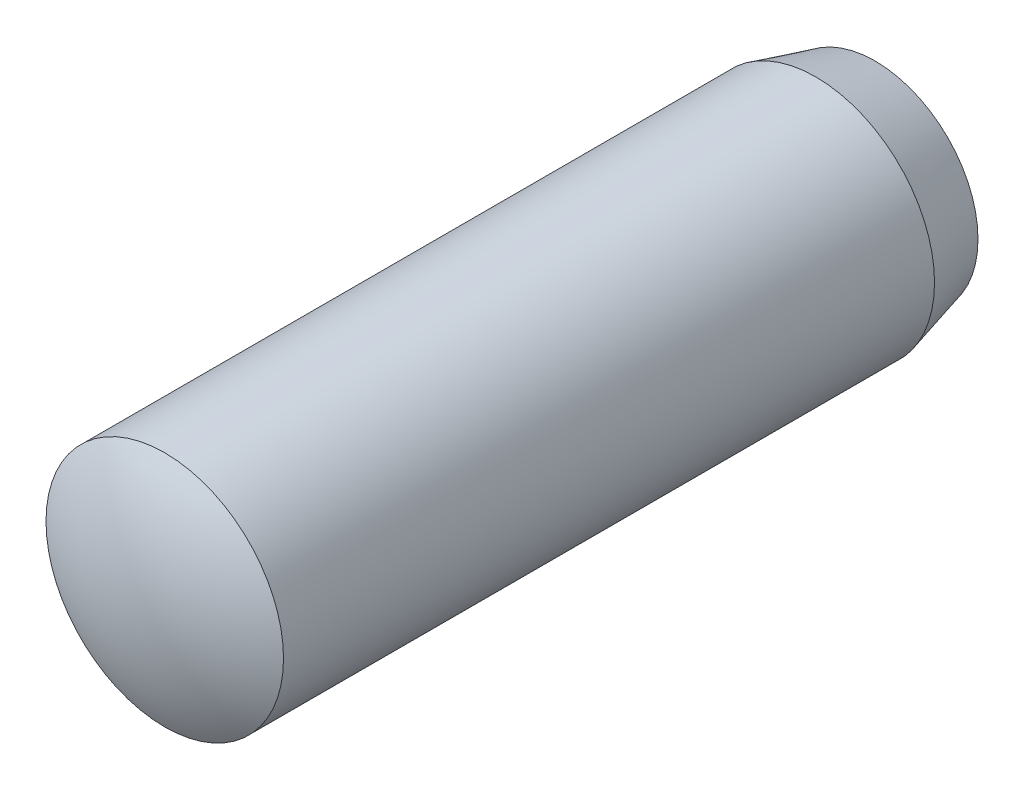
ISO-10303-21;
HEADER;
FILE_DESCRIPTION(('STEP AP214'),'2;1');
FILE_NAME('part.step','',(''),(''),'','','');
FILE_SCHEMA(('AUTOMOTIVE_DESIGN { 1 0 10303 214 1 1 1 1 }'));
ENDSEC;
DATA;
#1=APPLICATION_CONTEXT('core data for automotive mechanical design processes');
#2=APPLICATION_PROTOCOL_DEFINITION('international standard','automotive_design',2000,#1);
#3=PRODUCT_CONTEXT('',#1,'mechanical');
#4=PRODUCT('Part','Part','',(#3));
#5=PRODUCT_RELATED_PRODUCT_CATEGORY('part','',(#4));
#6=PRODUCT_DEFINITION_FORMATION('','',#4);
#7=PRODUCT_DEFINITION_CONTEXT('part definition',#1,'design');
#8=PRODUCT_DEFINITION('design','',#6,#7);
#9=PRODUCT_DEFINITION_SHAPE('','',#8);
#10=(LENGTH_UNIT() NAMED_UNIT(*) SI_UNIT(.MILLI.,.METRE.));
#11=(NAMED_UNIT(*) PLANE_ANGLE_UNIT() SI_UNIT($,.RADIAN.));
#12=(NAMED_UNIT(*) SI_UNIT($,.STERADIAN.) SOLID_ANGLE_UNIT());
#13=UNCERTAINTY_MEASURE_WITH_UNIT(LENGTH_MEASURE(1.E-05),#10,'distance_accuracy_value','');
#14=(GEOMETRIC_REPRESENTATION_CONTEXT(3) GLOBAL_UNCERTAINTY_ASSIGNED_CONTEXT((#13)) GLOBAL_UNIT_ASSIGNED_CONTEXT((#10,
#11,#12)) REPRESENTATION_CONTEXT('',''));
#15=CARTESIAN_POINT('',(0.,0.,0.));
#16=DIRECTION('',(0.,0.,1.));
#17=DIRECTION('',(1.,0.,0.));
#18=AXIS2_PLACEMENT_3D('',#15,#16,#17);
#19=CARTESIAN_POINT('',(29.5,-24.,7.));
#20=DIRECTION('',(0.,0.,1.));
#21=DIRECTION('',(1.,0.,0.));
#22=AXIS2_PLACEMENT_3D('',#19,#20,#21);
#23=SPHERICAL_SURFACE('',#22,8.);
#24=CARTESIAN_POINT('',(29.5,-24.,13.9282032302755));
#25=DIRECTION('',(0.,0.,1.));
#26=DIRECTION('',(0.,-1.,0.));
#27=AXIS2_PLACEMENT_3D('',#24,#25,#26);
#28=CIRCLE('',#27,4.);
#29=CARTESIAN_POINT('',(29.5,-28.,13.9282032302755));
#30=VERTEX_POINT('',#29);
#31=EDGE_CURVE('E8',#30,#30,#28,.T.);
#32=ORIENTED_EDGE('',*,*,#31,.T.);
#33=EDGE_LOOP('',(#32));
#34=FACE_BOUND('',#33,.T.);
#35=ADVANCED_FACE('F12',(#34),#23,.T.);
#36=CARTESIAN_POINT('',(29.5,-24.,27.5));
#37=DIRECTION('',(0.,0.,1.));
#38=DIRECTION('',(0.,-1.,0.));
#39=AXIS2_PLACEMENT_3D('',#36,#37,#38);
#40=CYLINDRICAL_SURFACE('',#39,4.);
#41=ORIENTED_EDGE('',*,*,#31,.F.);
#42=EDGE_LOOP('',(#41));
#43=FACE_BOUND('',#42,.T.);
#44=CARTESIAN_POINT('',(29.5,-24.,-8.));
#45=DIRECTION('',(0.,0.,1.));
#46=DIRECTION('',(0.,-1.,0.));
#47=AXIS2_PLACEMENT_3D('',#44,#45,#46);
#48=CIRCLE('',#47,4.);
#49=CARTESIAN_POINT('',(29.5,-28.,-8.));
#50=VERTEX_POINT('',#49);
#51=EDGE_CURVE('E18',#50,#50,#48,.T.);
#52=ORIENTED_EDGE('',*,*,#51,.T.);
#53=EDGE_LOOP('',(#52));
#54=FACE_BOUND('',#53,.T.);
#55=ADVANCED_FACE('F38',(#43,#54),#40,.T.);
#56=CARTESIAN_POINT('',(29.5,-24.,-10.));
#57=DIRECTION('',(0.,0.,1.));
#58=DIRECTION('',(0.,-1.,0.));
#59=AXIS2_PLACEMENT_3D('',#56,#57,#58);
#60=CONICAL_SURFACE('',#59,3.46410161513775,0.26179938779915);
#61=ORIENTED_EDGE('',*,*,#51,.F.);
#62=EDGE_LOOP('',(#61));
#63=FACE_BOUND('',#62,.T.);
#64=CARTESIAN_POINT('',(29.5,-24.,-10.));
#65=DIRECTION('',(0.,0.,1.));
#66=DIRECTION('',(0.,-1.,0.));
#67=AXIS2_PLACEMENT_3D('',#64,#65,#66);
#68=CIRCLE('',#67,3.46410161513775);
#69=CARTESIAN_POINT('',(29.5,-27.4641016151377,-10.));
#70=VERTEX_POINT('',#69);
#71=EDGE_CURVE('E22',#70,#70,#68,.T.);
#72=ORIENTED_EDGE('',*,*,#71,.T.);
#73=EDGE_LOOP('',(#72));
#74=FACE_BOUND('',#73,.T.);
#75=ADVANCED_FACE('F29',(#63,#74),#60,.T.);
#76=CARTESIAN_POINT('',(29.5,-24.,-10.));
#77=DIRECTION('',(0.,0.,1.));
#78=DIRECTION('',(0.,-1.,0.));
#79=AXIS2_PLACEMENT_3D('',#76,#77,#78);
#80=PLANE('',#79);
#81=ORIENTED_EDGE('',*,*,#71,.F.);
#82=EDGE_LOOP('',(#81));
#83=FACE_BOUND('',#82,.T.);
#84=ADVANCED_FACE('F31',(#83),#80,.F.);
#85=CLOSED_SHELL('',(#35,#55,#75,#84));
#86=MANIFOLD_SOLID_BREP('B1',#85);
#87=ADVANCED_BREP_SHAPE_REPRESENTATION('',(#18,#86),#14);
#88=SHAPE_DEFINITION_REPRESENTATION(#9,#87);
ENDSEC;
END-ISO-10303-21;
